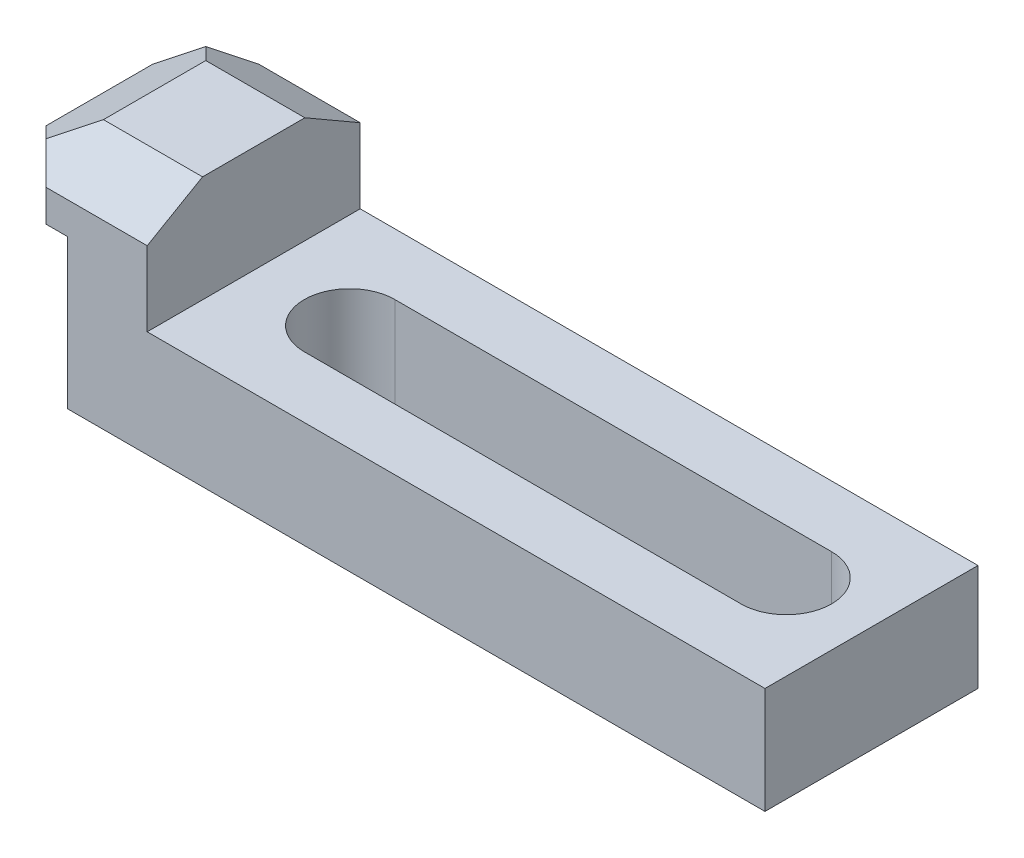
ISO-10303-21;
HEADER;
FILE_DESCRIPTION(('STEP AP214'),'2;1');
FILE_NAME('part.step','',(''),(''),'','','');
FILE_SCHEMA(('AUTOMOTIVE_DESIGN { 1 0 10303 214 1 1 1 1 }'));
ENDSEC;
DATA;
#1=APPLICATION_CONTEXT('core data for automotive mechanical design processes');
#2=APPLICATION_PROTOCOL_DEFINITION('international standard','automotive_design',2000,#1);
#3=PRODUCT_CONTEXT('',#1,'mechanical');
#4=PRODUCT('Part','Part','',(#3));
#5=PRODUCT_RELATED_PRODUCT_CATEGORY('part','',(#4));
#6=PRODUCT_DEFINITION_FORMATION('','',#4);
#7=PRODUCT_DEFINITION_CONTEXT('part definition',#1,'design');
#8=PRODUCT_DEFINITION('design','',#6,#7);
#9=PRODUCT_DEFINITION_SHAPE('','',#8);
#10=(LENGTH_UNIT() NAMED_UNIT(*) SI_UNIT(.MILLI.,.METRE.));
#11=(NAMED_UNIT(*) PLANE_ANGLE_UNIT() SI_UNIT($,.RADIAN.));
#12=(NAMED_UNIT(*) SI_UNIT($,.STERADIAN.) SOLID_ANGLE_UNIT());
#13=UNCERTAINTY_MEASURE_WITH_UNIT(LENGTH_MEASURE(1.E-05),#10,'distance_accuracy_value','');
#14=(GEOMETRIC_REPRESENTATION_CONTEXT(3) GLOBAL_UNCERTAINTY_ASSIGNED_CONTEXT((#13)) GLOBAL_UNIT_ASSIGNED_CONTEXT((#10,
#11,#12)) REPRESENTATION_CONTEXT('',''));
#15=CARTESIAN_POINT('',(0.,0.,0.));
#16=DIRECTION('',(0.,0.,1.));
#17=DIRECTION('',(1.,0.,0.));
#18=AXIS2_PLACEMENT_3D('',#15,#16,#17);
#19=CARTESIAN_POINT('',(0.,12.,20.));
#20=DIRECTION('',(1.,0.,0.));
#21=DIRECTION('',(0.,1.,0.));
#22=AXIS2_PLACEMENT_3D('',#19,#20,#21);
#23=PLANE('',#22);
#24=DIRECTION('',(0.,0.,-1.));
#25=VECTOR('',#24,1.);
#26=CARTESIAN_POINT('',(0.,5.99999999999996,20.));
#27=LINE('',#26,#25);
#28=CARTESIAN_POINT('',(0.,5.99999999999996,10.));
#29=VERTEX_POINT('',#28);
#30=CARTESIAN_POINT('',(0.,5.99999999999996,-10.));
#31=VERTEX_POINT('',#30);
#32=EDGE_CURVE('E171',#29,#31,#27,.T.);
#33=ORIENTED_EDGE('',*,*,#32,.T.);
#34=DIRECTION('',(0.,-1.,0.));
#35=VECTOR('',#34,1.);
#36=CARTESIAN_POINT('',(0.,12.,-10.));
#37=LINE('',#36,#35);
#38=CARTESIAN_POINT('',(0.,0.,-10.));
#39=VERTEX_POINT('',#38);
#40=EDGE_CURVE('E156',#31,#39,#37,.T.);
#41=ORIENTED_EDGE('',*,*,#40,.T.);
#42=DIRECTION('',(0.,0.,-1.));
#43=VECTOR('',#42,1.);
#44=CARTESIAN_POINT('',(0.,0.,20.));
#45=LINE('',#44,#43);
#46=CARTESIAN_POINT('',(0.,0.,10.));
#47=VERTEX_POINT('',#46);
#48=EDGE_CURVE('E235',#47,#39,#45,.T.);
#49=ORIENTED_EDGE('',*,*,#48,.F.);
#50=DIRECTION('',(0.,-1.,0.));
#51=VECTOR('',#50,1.);
#52=CARTESIAN_POINT('',(0.,12.,10.));
#53=LINE('',#52,#51);
#54=EDGE_CURVE('E177',#29,#47,#53,.T.);
#55=ORIENTED_EDGE('',*,*,#54,.F.);
#56=EDGE_LOOP('',(#33,#41,#49,#55));
#57=FACE_BOUND('',#56,.T.);
#58=ADVANCED_FACE('F39',(#57),#23,.F.);
#59=CARTESIAN_POINT('',(0.,0.,20.));
#60=DIRECTION('',(0.,1.,0.));
#61=DIRECTION('',(0.,0.,1.));
#62=AXIS2_PLACEMENT_3D('',#59,#60,#61);
#63=PLANE('',#62);
#64=ORIENTED_EDGE('',*,*,#48,.T.);
#65=DIRECTION('',(0.707106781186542,0.,-0.707106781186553));
#66=VECTOR('',#65,1.);
#67=CARTESIAN_POINT('',(-15.,0.,5.00000000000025));
#68=LINE('',#67,#66);
#69=CARTESIAN_POINT('',(9.99999999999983,0.,-20.));
#70=VERTEX_POINT('',#69);
#71=EDGE_CURVE('E159',#39,#70,#68,.T.);
#72=ORIENTED_EDGE('',*,*,#71,.T.);
#73=DIRECTION('',(1.,0.,0.));
#74=VECTOR('',#73,1.);
#75=CARTESIAN_POINT('',(0.,0.,-20.));
#76=LINE('',#75,#74);
#77=CARTESIAN_POINT('',(14.,0.,-20.));
#78=VERTEX_POINT('',#77);
#79=EDGE_CURVE('E198',#70,#78,#76,.T.);
#80=ORIENTED_EDGE('',*,*,#79,.T.);
#81=DIRECTION('',(0.,0.,-1.));
#82=VECTOR('',#81,1.);
#83=CARTESIAN_POINT('',(14.,0.,20.));
#84=LINE('',#83,#82);
#85=CARTESIAN_POINT('',(14.,0.,20.));
#86=VERTEX_POINT('',#85);
#87=EDGE_CURVE('E353',#86,#78,#84,.T.);
#88=ORIENTED_EDGE('',*,*,#87,.F.);
#89=DIRECTION('',(1.,0.,0.));
#90=VECTOR('',#89,1.);
#91=CARTESIAN_POINT('',(0.,0.,20.));
#92=LINE('',#91,#90);
#93=CARTESIAN_POINT('',(9.99999999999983,0.,20.));
#94=VERTEX_POINT('',#93);
#95=EDGE_CURVE('E311',#94,#86,#92,.T.);
#96=ORIENTED_EDGE('',*,*,#95,.F.);
#97=DIRECTION('',(-0.707106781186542,0.,-0.707106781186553));
#98=VECTOR('',#97,1.);
#99=CARTESIAN_POINT('',(5.,0.,15.0000000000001));
#100=LINE('',#99,#98);
#101=EDGE_CURVE('E282',#94,#47,#100,.T.);
#102=ORIENTED_EDGE('',*,*,#101,.T.);
#103=EDGE_LOOP('',(#64,#72,#80,#88,#96,#102));
#104=FACE_BOUND('',#103,.T.);
#105=ADVANCED_FACE('F358',(#104),#63,.F.);
#106=CARTESIAN_POINT('',(14.,0.,20.));
#107=DIRECTION('',(1.,0.,0.));
#108=DIRECTION('',(0.,1.,0.));
#109=AXIS2_PLACEMENT_3D('',#106,#107,#108);
#110=PLANE('',#109);
#111=DIRECTION('',(0.,-1.,0.));
#112=VECTOR('',#111,1.);
#113=CARTESIAN_POINT('',(14.,0.,-20.));
#114=LINE('',#113,#112);
#115=CARTESIAN_POINT('',(14.,-28.,-20.));
#116=VERTEX_POINT('',#115);
#117=EDGE_CURVE('E327',#78,#116,#114,.T.);
#118=ORIENTED_EDGE('',*,*,#117,.T.);
#119=DIRECTION('',(0.,0.,-1.));
#120=VECTOR('',#119,1.);
#121=CARTESIAN_POINT('',(14.,-28.,20.));
#122=LINE('',#121,#120);
#123=CARTESIAN_POINT('',(14.,-28.,20.));
#124=VERTEX_POINT('',#123);
#125=EDGE_CURVE('E350',#124,#116,#122,.T.);
#126=ORIENTED_EDGE('',*,*,#125,.F.);
#127=DIRECTION('',(0.,-1.,0.));
#128=VECTOR('',#127,1.);
#129=CARTESIAN_POINT('',(14.,0.,20.));
#130=LINE('',#129,#128);
#131=EDGE_CURVE('E314',#86,#124,#130,.T.);
#132=ORIENTED_EDGE('',*,*,#131,.F.);
#133=ORIENTED_EDGE('',*,*,#87,.T.);
#134=EDGE_LOOP('',(#118,#126,#132,#133));
#135=FACE_BOUND('',#134,.T.);
#136=ADVANCED_FACE('F381',(#135),#110,.F.);
#137=CARTESIAN_POINT('',(14.,-28.,20.));
#138=DIRECTION('',(0.,1.,0.));
#139=DIRECTION('',(0.,0.,1.));
#140=AXIS2_PLACEMENT_3D('',#137,#138,#139);
#141=PLANE('',#140);
#142=DIRECTION('',(1.,0.,0.));
#143=VECTOR('',#142,1.);
#144=CARTESIAN_POINT('',(47.,-28.,-8.5));
#145=LINE('',#144,#143);
#146=CARTESIAN_POINT('',(47.,-28.,-8.5));
#147=VERTEX_POINT('',#146);
#148=CARTESIAN_POINT('',(129.,-28.,-8.5));
#149=VERTEX_POINT('',#148);
#150=EDGE_CURVE('E288',#147,#149,#145,.T.);
#151=ORIENTED_EDGE('',*,*,#150,.F.);
#152=CARTESIAN_POINT('',(47.,-28.,0.));
#153=DIRECTION('',(0.,-1.,0.));
#154=DIRECTION('',(0.,0.,-1.));
#155=AXIS2_PLACEMENT_3D('',#152,#153,#154);
#156=CIRCLE('',#155,8.5);
#157=CARTESIAN_POINT('',(47.,-28.,8.5));
#158=VERTEX_POINT('',#157);
#159=EDGE_CURVE('E285',#158,#147,#156,.T.);
#160=ORIENTED_EDGE('',*,*,#159,.F.);
#161=DIRECTION('',(-1.,0.,0.));
#162=VECTOR('',#161,1.);
#163=CARTESIAN_POINT('',(47.,-28.,8.5));
#164=LINE('',#163,#162);
#165=CARTESIAN_POINT('',(129.,-28.,8.5));
#166=VERTEX_POINT('',#165);
#167=EDGE_CURVE('E296',#166,#158,#164,.T.);
#168=ORIENTED_EDGE('',*,*,#167,.F.);
#169=CARTESIAN_POINT('',(129.,-28.,0.));
#170=DIRECTION('',(0.,-1.,0.));
#171=DIRECTION('',(0.,0.,-1.));
#172=AXIS2_PLACEMENT_3D('',#169,#170,#171);
#173=CIRCLE('',#172,8.5);
#174=EDGE_CURVE('E292',#149,#166,#173,.T.);
#175=ORIENTED_EDGE('',*,*,#174,.F.);
#176=EDGE_LOOP('',(#151,#160,#168,#175));
#177=FACE_BOUND('',#176,.T.);
#178=DIRECTION('',(1.,0.,0.));
#179=VECTOR('',#178,1.);
#180=CARTESIAN_POINT('',(14.,-28.,-20.));
#181=LINE('',#180,#179);
#182=CARTESIAN_POINT('',(145.,-28.,-20.));
#183=VERTEX_POINT('',#182);
#184=EDGE_CURVE('E330',#116,#183,#181,.T.);
#185=ORIENTED_EDGE('',*,*,#184,.T.);
#186=DIRECTION('',(0.,0.,-1.));
#187=VECTOR('',#186,1.);
#188=CARTESIAN_POINT('',(145.,-28.,20.));
#189=LINE('',#188,#187);
#190=CARTESIAN_POINT('',(145.,-28.,20.));
#191=VERTEX_POINT('',#190);
#192=EDGE_CURVE('E346',#191,#183,#189,.T.);
#193=ORIENTED_EDGE('',*,*,#192,.F.);
#194=DIRECTION('',(1.,0.,0.));
#195=VECTOR('',#194,1.);
#196=CARTESIAN_POINT('',(14.,-28.,20.));
#197=LINE('',#196,#195);
#198=EDGE_CURVE('E317',#124,#191,#197,.T.);
#199=ORIENTED_EDGE('',*,*,#198,.F.);
#200=ORIENTED_EDGE('',*,*,#125,.T.);
#201=EDGE_LOOP('',(#185,#193,#199,#200));
#202=FACE_BOUND('',#201,.T.);
#203=ADVANCED_FACE('F378',(#177,#202),#141,.F.);
#204=CARTESIAN_POINT('',(145.,-28.,20.));
#205=DIRECTION('',(-1.,0.,0.));
#206=DIRECTION('',(0.,0.,1.));
#207=AXIS2_PLACEMENT_3D('',#204,#205,#206);
#208=PLANE('',#207);
#209=DIRECTION('',(0.,1.,0.));
#210=VECTOR('',#209,1.);
#211=CARTESIAN_POINT('',(145.,-28.,-20.));
#212=LINE('',#211,#210);
#213=CARTESIAN_POINT('',(145.,-8.,-20.));
#214=VERTEX_POINT('',#213);
#215=EDGE_CURVE('E333',#183,#214,#212,.T.);
#216=ORIENTED_EDGE('',*,*,#215,.T.);
#217=DIRECTION('',(0.,0.,-1.));
#218=VECTOR('',#217,1.);
#219=CARTESIAN_POINT('',(145.,-8.,20.));
#220=LINE('',#219,#218);
#221=CARTESIAN_POINT('',(145.,-8.,20.));
#222=VERTEX_POINT('',#221);
#223=EDGE_CURVE('E342',#222,#214,#220,.T.);
#224=ORIENTED_EDGE('',*,*,#223,.F.);
#225=DIRECTION('',(0.,1.,0.));
#226=VECTOR('',#225,1.);
#227=CARTESIAN_POINT('',(145.,-28.,20.));
#228=LINE('',#227,#226);
#229=EDGE_CURVE('E319',#191,#222,#228,.T.);
#230=ORIENTED_EDGE('',*,*,#229,.F.);
#231=ORIENTED_EDGE('',*,*,#192,.T.);
#232=EDGE_LOOP('',(#216,#224,#230,#231));
#233=FACE_BOUND('',#232,.T.);
#234=ADVANCED_FACE('F374',(#233),#208,.F.);
#235=CARTESIAN_POINT('',(145.,-8.,20.));
#236=DIRECTION('',(0.,-1.,0.));
#237=DIRECTION('',(1.,0.,0.));
#238=AXIS2_PLACEMENT_3D('',#235,#236,#237);
#239=PLANE('',#238);
#240=DIRECTION('',(-1.,0.,0.));
#241=VECTOR('',#240,1.);
#242=CARTESIAN_POINT('',(145.,-8.,8.5));
#243=LINE('',#242,#241);
#244=CARTESIAN_POINT('',(129.,-8.,8.5));
#245=VERTEX_POINT('',#244);
#246=CARTESIAN_POINT('',(47.,-8.,8.5));
#247=VERTEX_POINT('',#246);
#248=EDGE_CURVE('E203',#245,#247,#243,.T.);
#249=ORIENTED_EDGE('',*,*,#248,.T.);
#250=CARTESIAN_POINT('',(47.,-8.00000000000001,0.));
#251=DIRECTION('',(0.,-1.,0.));
#252=DIRECTION('',(1.,0.,0.));
#253=AXIS2_PLACEMENT_3D('',#250,#251,#252);
#254=CIRCLE('',#253,8.5);
#255=CARTESIAN_POINT('',(47.,-8.,-8.5));
#256=VERTEX_POINT('',#255);
#257=EDGE_CURVE('E207',#247,#256,#254,.T.);
#258=ORIENTED_EDGE('',*,*,#257,.T.);
#259=DIRECTION('',(1.,0.,0.));
#260=VECTOR('',#259,1.);
#261=CARTESIAN_POINT('',(145.,-8.,-8.5));
#262=LINE('',#261,#260);
#263=CARTESIAN_POINT('',(129.,-8.,-8.5));
#264=VERTEX_POINT('',#263);
#265=EDGE_CURVE('E179',#256,#264,#262,.T.);
#266=ORIENTED_EDGE('',*,*,#265,.T.);
#267=CARTESIAN_POINT('',(129.,-8.,0.));
#268=DIRECTION('',(0.,-1.,0.));
#269=DIRECTION('',(1.,0.,0.));
#270=AXIS2_PLACEMENT_3D('',#267,#268,#269);
#271=CIRCLE('',#270,8.5);
#272=EDGE_CURVE('E185',#264,#245,#271,.T.);
#273=ORIENTED_EDGE('',*,*,#272,.T.);
#274=EDGE_LOOP('',(#249,#258,#266,#273));
#275=FACE_BOUND('',#274,.T.);
#276=DIRECTION('',(-1.,0.,0.));
#277=VECTOR('',#276,1.);
#278=CARTESIAN_POINT('',(145.,-8.,-20.));
#279=LINE('',#278,#277);
#280=CARTESIAN_POINT('',(29.,-8.00000000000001,-20.));
#281=VERTEX_POINT('',#280);
#282=EDGE_CURVE('E335',#214,#281,#279,.T.);
#283=ORIENTED_EDGE('',*,*,#282,.T.);
#284=DIRECTION('',(0.,0.,-1.));
#285=VECTOR('',#284,1.);
#286=CARTESIAN_POINT('',(29.,-8.00000000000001,20.));
#287=LINE('',#286,#285);
#288=CARTESIAN_POINT('',(29.,-8.00000000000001,20.));
#289=VERTEX_POINT('',#288);
#290=EDGE_CURVE('E258',#289,#281,#287,.T.);
#291=ORIENTED_EDGE('',*,*,#290,.F.);
#292=DIRECTION('',(-1.,0.,0.));
#293=VECTOR('',#292,1.);
#294=CARTESIAN_POINT('',(145.,-8.,20.));
#295=LINE('',#294,#293);
#296=EDGE_CURVE('E322',#222,#289,#295,.T.);
#297=ORIENTED_EDGE('',*,*,#296,.F.);
#298=ORIENTED_EDGE('',*,*,#223,.T.);
#299=EDGE_LOOP('',(#283,#291,#297,#298));
#300=FACE_BOUND('',#299,.T.);
#301=ADVANCED_FACE('F370',(#275,#300),#239,.F.);
#302=CARTESIAN_POINT('',(29.,-8.00000000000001,20.));
#303=DIRECTION('',(-1.,0.,0.));
#304=DIRECTION('',(0.,-1.,0.));
#305=AXIS2_PLACEMENT_3D('',#302,#303,#304);
#306=PLANE('',#305);
#307=DIRECTION('',(0.,1.,0.));
#308=VECTOR('',#307,1.);
#309=CARTESIAN_POINT('',(29.,-8.00000000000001,-20.));
#310=LINE('',#309,#308);
#311=CARTESIAN_POINT('',(29.,5.99999999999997,-20.));
#312=VERTEX_POINT('',#311);
#313=EDGE_CURVE('E252',#281,#312,#310,.T.);
#314=ORIENTED_EDGE('',*,*,#313,.T.);
#315=DIRECTION('',(0.,-0.500000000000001,-0.866025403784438));
#316=VECTOR('',#315,1.);
#317=CARTESIAN_POINT('',(29.,12.,-9.60769515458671));
#318=LINE('',#317,#316);
#319=CARTESIAN_POINT('',(29.,12.,-9.60769515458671));
#320=VERTEX_POINT('',#319);
#321=EDGE_CURVE('E189',#312,#320,#318,.F.);
#322=ORIENTED_EDGE('',*,*,#321,.T.);
#323=DIRECTION('',(0.,0.,-1.));
#324=VECTOR('',#323,1.);
#325=CARTESIAN_POINT('',(29.,12.,20.));
#326=LINE('',#325,#324);
#327=CARTESIAN_POINT('',(29.,12.,9.60769515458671));
#328=VERTEX_POINT('',#327);
#329=EDGE_CURVE('E249',#328,#320,#326,.T.);
#330=ORIENTED_EDGE('',*,*,#329,.F.);
#331=DIRECTION('',(0.,-0.500000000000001,0.866025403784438));
#332=VECTOR('',#331,1.);
#333=CARTESIAN_POINT('',(29.,5.99999999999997,20.));
#334=LINE('',#333,#332);
#335=CARTESIAN_POINT('',(29.,5.99999999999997,20.));
#336=VERTEX_POINT('',#335);
#337=EDGE_CURVE('E221',#328,#336,#334,.T.);
#338=ORIENTED_EDGE('',*,*,#337,.T.);
#339=DIRECTION('',(0.,1.,0.));
#340=VECTOR('',#339,1.);
#341=CARTESIAN_POINT('',(29.,-8.00000000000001,20.));
#342=LINE('',#341,#340);
#343=EDGE_CURVE('E259',#289,#336,#342,.T.);
#344=ORIENTED_EDGE('',*,*,#343,.F.);
#345=ORIENTED_EDGE('',*,*,#290,.T.);
#346=EDGE_LOOP('',(#314,#322,#330,#338,#344,#345));
#347=FACE_BOUND('',#346,.T.);
#348=ADVANCED_FACE('F248',(#347),#306,.F.);
#349=CARTESIAN_POINT('',(29.,12.,20.));
#350=DIRECTION('',(0.,-1.,0.));
#351=DIRECTION('',(1.,0.,0.));
#352=AXIS2_PLACEMENT_3D('',#349,#350,#351);
#353=PLANE('',#352);
#354=ORIENTED_EDGE('',*,*,#329,.T.);
#355=DIRECTION('',(-1.,0.,0.));
#356=VECTOR('',#355,1.);
#357=CARTESIAN_POINT('',(29.,12.,-9.60769515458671));
#358=LINE('',#357,#356);
#359=CARTESIAN_POINT('',(10.3923048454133,12.,-9.60769515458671));
#360=VERTEX_POINT('',#359);
#361=EDGE_CURVE('E226',#320,#360,#358,.T.);
#362=ORIENTED_EDGE('',*,*,#361,.T.);
#363=DIRECTION('',(0.,0.,1.));
#364=VECTOR('',#363,1.);
#365=CARTESIAN_POINT('',(10.3923048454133,12.,20.));
#366=LINE('',#365,#364);
#367=CARTESIAN_POINT('',(10.3923048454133,12.,9.60769515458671));
#368=VERTEX_POINT('',#367);
#369=EDGE_CURVE('E227',#360,#368,#366,.T.);
#370=ORIENTED_EDGE('',*,*,#369,.T.);
#371=DIRECTION('',(1.,0.,0.));
#372=VECTOR('',#371,1.);
#373=CARTESIAN_POINT('',(29.,12.,9.60769515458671));
#374=LINE('',#373,#372);
#375=EDGE_CURVE('E220',#368,#328,#374,.T.);
#376=ORIENTED_EDGE('',*,*,#375,.T.);
#377=EDGE_LOOP('',(#354,#362,#370,#376));
#378=FACE_BOUND('',#377,.T.);
#379=ADVANCED_FACE('F256',(#378),#353,.F.);
#380=CARTESIAN_POINT('',(0.,0.,20.));
#381=DIRECTION('',(0.,0.,1.));
#382=DIRECTION('',(1.,0.,0.));
#383=AXIS2_PLACEMENT_3D('',#380,#381,#382);
#384=PLANE('',#383);
#385=DIRECTION('',(0.,-1.,0.));
#386=VECTOR('',#385,1.);
#387=CARTESIAN_POINT('',(9.99999999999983,12.,20.));
#388=LINE('',#387,#386);
#389=CARTESIAN_POINT('',(9.99999999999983,5.99999999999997,20.));
#390=VERTEX_POINT('',#389);
#391=EDGE_CURVE('E274',#390,#94,#388,.T.);
#392=ORIENTED_EDGE('',*,*,#391,.T.);
#393=ORIENTED_EDGE('',*,*,#95,.T.);
#394=ORIENTED_EDGE('',*,*,#131,.T.);
#395=ORIENTED_EDGE('',*,*,#198,.T.);
#396=ORIENTED_EDGE('',*,*,#229,.T.);
#397=ORIENTED_EDGE('',*,*,#296,.T.);
#398=ORIENTED_EDGE('',*,*,#343,.T.);
#399=DIRECTION('',(-1.,0.,0.));
#400=VECTOR('',#399,1.);
#401=CARTESIAN_POINT('',(0.,5.99999999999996,20.));
#402=LINE('',#401,#400);
#403=EDGE_CURVE('E180',#336,#390,#402,.T.);
#404=ORIENTED_EDGE('',*,*,#403,.T.);
#405=EDGE_LOOP('',(#392,#393,#394,#395,#396,#397,#398,#404));
#406=FACE_BOUND('',#405,.T.);
#407=ADVANCED_FACE('F362',(#406),#384,.T.);
#408=CARTESIAN_POINT('',(0.,0.,-20.));
#409=DIRECTION('',(0.,0.,1.));
#410=DIRECTION('',(1.,0.,0.));
#411=AXIS2_PLACEMENT_3D('',#408,#409,#410);
#412=PLANE('',#411);
#413=ORIENTED_EDGE('',*,*,#79,.F.);
#414=DIRECTION('',(0.,-1.,0.));
#415=VECTOR('',#414,1.);
#416=CARTESIAN_POINT('',(9.99999999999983,12.,-20.));
#417=LINE('',#416,#415);
#418=CARTESIAN_POINT('',(9.99999999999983,5.99999999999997,-20.));
#419=VERTEX_POINT('',#418);
#420=EDGE_CURVE('E165',#419,#70,#417,.T.);
#421=ORIENTED_EDGE('',*,*,#420,.F.);
#422=DIRECTION('',(1.,0.,0.));
#423=VECTOR('',#422,1.);
#424=CARTESIAN_POINT('',(0.,5.99999999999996,-20.));
#425=LINE('',#424,#423);
#426=EDGE_CURVE('E232',#419,#312,#425,.T.);
#427=ORIENTED_EDGE('',*,*,#426,.T.);
#428=ORIENTED_EDGE('',*,*,#313,.F.);
#429=ORIENTED_EDGE('',*,*,#282,.F.);
#430=ORIENTED_EDGE('',*,*,#215,.F.);
#431=ORIENTED_EDGE('',*,*,#184,.F.);
#432=ORIENTED_EDGE('',*,*,#117,.F.);
#433=EDGE_LOOP('',(#413,#421,#427,#428,#429,#430,#431,#432));
#434=FACE_BOUND('',#433,.T.);
#435=ADVANCED_FACE('F265',(#434),#412,.F.);
#436=CARTESIAN_POINT('',(0.,5.99999999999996,20.));
#437=DIRECTION('',(0.,0.866025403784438,0.500000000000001));
#438=DIRECTION('',(0.,-0.500000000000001,0.866025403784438));
#439=AXIS2_PLACEMENT_3D('',#436,#437,#438);
#440=PLANE('',#439);
#441=DIRECTION('',(-0.654653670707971,0.377964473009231,-0.654653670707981));
#442=VECTOR('',#441,1.);
#443=CARTESIAN_POINT('',(5.7142857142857,8.47435829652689,15.7142857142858));
#444=LINE('',#443,#442);
#445=CARTESIAN_POINT('',(4.99999999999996,8.88675134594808,15.));
#446=VERTEX_POINT('',#445);
#447=EDGE_CURVE('E62',#390,#446,#444,.T.);
#448=ORIENTED_EDGE('',*,*,#447,.F.);
#449=ORIENTED_EDGE('',*,*,#403,.F.);
#450=ORIENTED_EDGE('',*,*,#337,.F.);
#451=ORIENTED_EDGE('',*,*,#375,.F.);
#452=DIRECTION('',(-0.654653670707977,-0.377964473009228,0.654653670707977));
#453=VECTOR('',#452,1.);
#454=CARTESIAN_POINT('',(0.,5.99999999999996,20.));
#455=LINE('',#454,#453);
#456=EDGE_CURVE('E195',#446,#368,#455,.F.);
#457=ORIENTED_EDGE('',*,*,#456,.F.);
#458=EDGE_LOOP('',(#448,#449,#450,#451,#457));
#459=FACE_BOUND('',#458,.T.);
#460=ADVANCED_FACE('F41',(#459),#440,.T.);
#461=CARTESIAN_POINT('',(0.,5.99999999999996,20.));
#462=DIRECTION('',(0.500000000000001,-0.866025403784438,0.));
#463=DIRECTION('',(0.866025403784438,0.500000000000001,0.));
#464=AXIS2_PLACEMENT_3D('',#461,#462,#463);
#465=PLANE('',#464);
#466=DIRECTION('',(-0.654653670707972,-0.377964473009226,0.654653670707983));
#467=VECTOR('',#466,1.);
#468=CARTESIAN_POINT('',(-12.8571428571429,-1.42307488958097,2.85714285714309));
#469=LINE('',#468,#467);
#470=CARTESIAN_POINT('',(4.99999999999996,8.88675134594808,-15.));
#471=VERTEX_POINT('',#470);
#472=EDGE_CURVE('E54',#31,#471,#469,.F.);
#473=ORIENTED_EDGE('',*,*,#472,.F.);
#474=ORIENTED_EDGE('',*,*,#32,.F.);
#475=DIRECTION('',(0.654653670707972,0.377964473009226,0.654653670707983));
#476=VECTOR('',#475,1.);
#477=CARTESIAN_POINT('',(4.28571428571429,8.47435829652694,14.2857142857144));
#478=LINE('',#477,#476);
#479=EDGE_CURVE('E48',#446,#29,#478,.F.);
#480=ORIENTED_EDGE('',*,*,#479,.F.);
#481=ORIENTED_EDGE('',*,*,#456,.T.);
#482=ORIENTED_EDGE('',*,*,#369,.F.);
#483=DIRECTION('',(-0.654653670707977,-0.377964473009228,-0.654653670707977));
#484=VECTOR('',#483,1.);
#485=CARTESIAN_POINT('',(17.1428571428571,15.8974331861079,-2.85714285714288));
#486=LINE('',#485,#484);
#487=EDGE_CURVE('E173',#471,#360,#486,.F.);
#488=ORIENTED_EDGE('',*,*,#487,.F.);
#489=EDGE_LOOP('',(#473,#474,#480,#481,#482,#488));
#490=FACE_BOUND('',#489,.T.);
#491=ADVANCED_FACE('F170',(#490),#465,.F.);
#492=CARTESIAN_POINT('',(29.,12.,-9.60769515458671));
#493=DIRECTION('',(0.,-0.866025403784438,0.500000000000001));
#494=DIRECTION('',(0.,-0.500000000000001,-0.866025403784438));
#495=AXIS2_PLACEMENT_3D('',#492,#493,#494);
#496=PLANE('',#495);
#497=DIRECTION('',(-0.654653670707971,0.377964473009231,0.654653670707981));
#498=VECTOR('',#497,1.);
#499=CARTESIAN_POINT('',(12.2043972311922,4.72729066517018,-22.2043972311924));
#500=LINE('',#499,#498);
#501=EDGE_CURVE('E11',#471,#419,#500,.F.);
#502=ORIENTED_EDGE('',*,*,#501,.F.);
#503=ORIENTED_EDGE('',*,*,#487,.T.);
#504=ORIENTED_EDGE('',*,*,#361,.F.);
#505=ORIENTED_EDGE('',*,*,#321,.F.);
#506=ORIENTED_EDGE('',*,*,#426,.F.);
#507=EDGE_LOOP('',(#502,#503,#504,#505,#506));
#508=FACE_BOUND('',#507,.T.);
#509=ADVANCED_FACE('F261',(#508),#496,.F.);
#510=CARTESIAN_POINT('',(47.,12.,0.));
#511=DIRECTION('',(0.,-1.,0.));
#512=DIRECTION('',(0.,0.,-1.));
#513=AXIS2_PLACEMENT_3D('',#510,#511,#512);
#514=CYLINDRICAL_SURFACE('',#513,8.5);
#515=DIRECTION('',(0.,-1.,0.));
#516=VECTOR('',#515,1.);
#517=CARTESIAN_POINT('',(47.,12.,8.5));
#518=LINE('',#517,#516);
#519=EDGE_CURVE('E196',#247,#158,#518,.T.);
#520=ORIENTED_EDGE('',*,*,#519,.T.);
#521=ORIENTED_EDGE('',*,*,#159,.T.);
#522=DIRECTION('',(0.,-1.,0.));
#523=VECTOR('',#522,1.);
#524=CARTESIAN_POINT('',(47.,12.,-8.5));
#525=LINE('',#524,#523);
#526=EDGE_CURVE('E299',#256,#147,#525,.T.);
#527=ORIENTED_EDGE('',*,*,#526,.F.);
#528=ORIENTED_EDGE('',*,*,#257,.F.);
#529=EDGE_LOOP('',(#520,#521,#527,#528));
#530=FACE_BOUND('',#529,.T.);
#531=ADVANCED_FACE('F398',(#530),#514,.F.);
#532=CARTESIAN_POINT('',(47.,12.,8.5));
#533=DIRECTION('',(0.,0.,1.));
#534=DIRECTION('',(1.,0.,0.));
#535=AXIS2_PLACEMENT_3D('',#532,#533,#534);
#536=PLANE('',#535);
#537=DIRECTION('',(0.,-1.,0.));
#538=VECTOR('',#537,1.);
#539=CARTESIAN_POINT('',(129.,12.,8.5));
#540=LINE('',#539,#538);
#541=EDGE_CURVE('E302',#245,#166,#540,.T.);
#542=ORIENTED_EDGE('',*,*,#541,.T.);
#543=ORIENTED_EDGE('',*,*,#167,.T.);
#544=ORIENTED_EDGE('',*,*,#519,.F.);
#545=ORIENTED_EDGE('',*,*,#248,.F.);
#546=EDGE_LOOP('',(#542,#543,#544,#545));
#547=FACE_BOUND('',#546,.T.);
#548=ADVANCED_FACE('F458',(#547),#536,.F.);
#549=CARTESIAN_POINT('',(129.,12.,0.));
#550=DIRECTION('',(0.,-1.,0.));
#551=DIRECTION('',(0.,0.,-1.));
#552=AXIS2_PLACEMENT_3D('',#549,#550,#551);
#553=CYLINDRICAL_SURFACE('',#552,8.5);
#554=DIRECTION('',(0.,-1.,0.));
#555=VECTOR('',#554,1.);
#556=CARTESIAN_POINT('',(129.,12.,-8.5));
#557=LINE('',#556,#555);
#558=EDGE_CURVE('E305',#264,#149,#557,.T.);
#559=ORIENTED_EDGE('',*,*,#558,.T.);
#560=ORIENTED_EDGE('',*,*,#174,.T.);
#561=ORIENTED_EDGE('',*,*,#541,.F.);
#562=ORIENTED_EDGE('',*,*,#272,.F.);
#563=EDGE_LOOP('',(#559,#560,#561,#562));
#564=FACE_BOUND('',#563,.T.);
#565=ADVANCED_FACE('F466',(#564),#553,.F.);
#566=CARTESIAN_POINT('',(47.,12.,-8.5));
#567=DIRECTION('',(0.,0.,-1.));
#568=DIRECTION('',(-1.,0.,0.));
#569=AXIS2_PLACEMENT_3D('',#566,#567,#568);
#570=PLANE('',#569);
#571=ORIENTED_EDGE('',*,*,#526,.T.);
#572=ORIENTED_EDGE('',*,*,#150,.T.);
#573=ORIENTED_EDGE('',*,*,#558,.F.);
#574=ORIENTED_EDGE('',*,*,#265,.F.);
#575=EDGE_LOOP('',(#571,#572,#573,#574));
#576=FACE_BOUND('',#575,.T.);
#577=ADVANCED_FACE('F475',(#576),#570,.F.);
#578=CARTESIAN_POINT('',(9.99999999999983,12.,20.));
#579=DIRECTION('',(0.707106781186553,0.,-0.707106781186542));
#580=DIRECTION('',(-0.707106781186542,0.,-0.707106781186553));
#581=AXIS2_PLACEMENT_3D('',#578,#579,#580);
#582=PLANE('',#581);
#583=ORIENTED_EDGE('',*,*,#391,.F.);
#584=ORIENTED_EDGE('',*,*,#447,.T.);
#585=ORIENTED_EDGE('',*,*,#479,.T.);
#586=ORIENTED_EDGE('',*,*,#54,.T.);
#587=ORIENTED_EDGE('',*,*,#101,.F.);
#588=EDGE_LOOP('',(#583,#584,#585,#586,#587));
#589=FACE_BOUND('',#588,.T.);
#590=ADVANCED_FACE('F212',(#589),#582,.F.);
#591=CARTESIAN_POINT('',(9.99999999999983,12.,-20.));
#592=DIRECTION('',(0.707106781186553,0.,0.707106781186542));
#593=DIRECTION('',(0.707106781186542,0.,-0.707106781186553));
#594=AXIS2_PLACEMENT_3D('',#591,#592,#593);
#595=PLANE('',#594);
#596=ORIENTED_EDGE('',*,*,#40,.F.);
#597=ORIENTED_EDGE('',*,*,#472,.T.);
#598=ORIENTED_EDGE('',*,*,#501,.T.);
#599=ORIENTED_EDGE('',*,*,#420,.T.);
#600=ORIENTED_EDGE('',*,*,#71,.F.);
#601=EDGE_LOOP('',(#596,#597,#598,#599,#600));
#602=FACE_BOUND('',#601,.T.);
#603=ADVANCED_FACE('F157',(#602),#595,.F.);
#604=CLOSED_SHELL('',(#58,#105,#136,#203,#234,#301,#348,#379,#407,#435,#460,#491,#509,#531,#548,
#565,#577,#590,#603));
#605=MANIFOLD_SOLID_BREP('B2',#604);
#606=ADVANCED_BREP_SHAPE_REPRESENTATION('',(#18,#605),#14);
#607=SHAPE_DEFINITION_REPRESENTATION(#9,#606);
ENDSEC;
END-ISO-10303-21;
